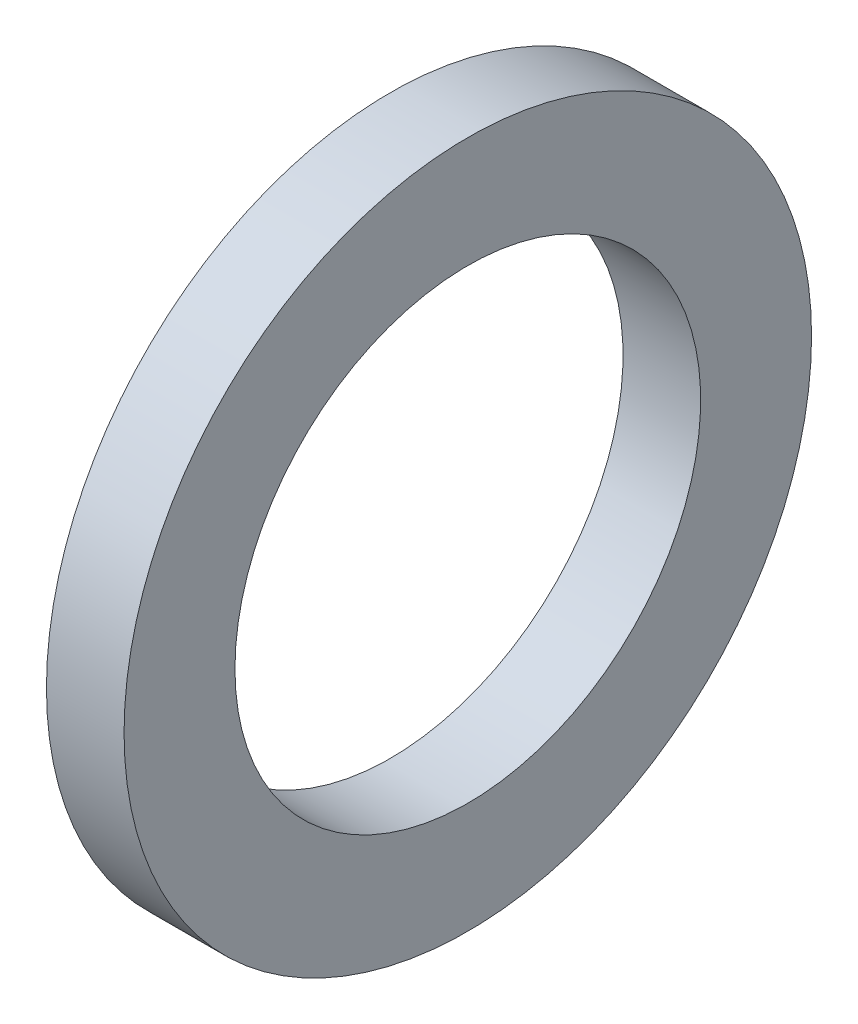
ISO-10303-21;
HEADER;
FILE_DESCRIPTION(('STEP AP214'),'2;1');
FILE_NAME('part.step','',(''),(''),'','','');
FILE_SCHEMA(('AUTOMOTIVE_DESIGN { 1 0 10303 214 1 1 1 1 }'));
ENDSEC;
DATA;
#1=APPLICATION_CONTEXT('core data for automotive mechanical design processes');
#2=APPLICATION_PROTOCOL_DEFINITION('international standard','automotive_design',2000,#1);
#3=PRODUCT_CONTEXT('',#1,'mechanical');
#4=PRODUCT('Part','Part','',(#3));
#5=PRODUCT_RELATED_PRODUCT_CATEGORY('part','',(#4));
#6=PRODUCT_DEFINITION_FORMATION('','',#4);
#7=PRODUCT_DEFINITION_CONTEXT('part definition',#1,'design');
#8=PRODUCT_DEFINITION('design','',#6,#7);
#9=PRODUCT_DEFINITION_SHAPE('','',#8);
#10=(LENGTH_UNIT() NAMED_UNIT(*) SI_UNIT(.MILLI.,.METRE.));
#11=(NAMED_UNIT(*) PLANE_ANGLE_UNIT() SI_UNIT($,.RADIAN.));
#12=(NAMED_UNIT(*) SI_UNIT($,.STERADIAN.) SOLID_ANGLE_UNIT());
#13=UNCERTAINTY_MEASURE_WITH_UNIT(LENGTH_MEASURE(1.E-05),#10,'distance_accuracy_value','');
#14=(GEOMETRIC_REPRESENTATION_CONTEXT(3) GLOBAL_UNCERTAINTY_ASSIGNED_CONTEXT((#13)) GLOBAL_UNIT_ASSIGNED_CONTEXT((#10,
#11,#12)) REPRESENTATION_CONTEXT('',''));
#15=CARTESIAN_POINT('',(0.,0.,0.));
#16=DIRECTION('',(0.,0.,1.));
#17=DIRECTION('',(1.,0.,0.));
#18=AXIS2_PLACEMENT_3D('',#15,#16,#17);
#19=CARTESIAN_POINT('',(-34.9249999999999,0.,0.));
#20=DIRECTION('',(-1.,0.,0.));
#21=DIRECTION('',(0.,0.,1.));
#22=AXIS2_PLACEMENT_3D('',#19,#20,#21);
#23=CYLINDRICAL_SURFACE('',#22,10.5);
#24=CARTESIAN_POINT('',(0.,0.,0.));
#25=DIRECTION('',(-1.,0.,0.));
#26=DIRECTION('',(0.,0.,1.));
#27=AXIS2_PLACEMENT_3D('',#24,#25,#26);
#28=CIRCLE('',#27,10.5);
#29=CARTESIAN_POINT('',(0.,0.,10.5));
#30=VERTEX_POINT('',#29);
#31=EDGE_CURVE('E10',#30,#30,#28,.T.);
#32=ORIENTED_EDGE('',*,*,#31,.F.);
#33=EDGE_LOOP('',(#32));
#34=FACE_BOUND('',#33,.T.);
#35=CARTESIAN_POINT('',(-3.5,0.,0.));
#36=DIRECTION('',(-1.,0.,0.));
#37=DIRECTION('',(0.,0.,1.));
#38=AXIS2_PLACEMENT_3D('',#35,#36,#37);
#39=CIRCLE('',#38,10.5);
#40=CARTESIAN_POINT('',(-3.5,0.,10.5));
#41=VERTEX_POINT('',#40);
#42=EDGE_CURVE('E51',#41,#41,#39,.T.);
#43=ORIENTED_EDGE('',*,*,#42,.T.);
#44=EDGE_LOOP('',(#43));
#45=FACE_BOUND('',#44,.T.);
#46=ADVANCED_FACE('F40',(#34,#45),#23,.F.);
#47=CARTESIAN_POINT('',(0.,10.5,0.));
#48=DIRECTION('',(-1.,0.,0.));
#49=DIRECTION('',(0.,0.,1.));
#50=AXIS2_PLACEMENT_3D('',#47,#48,#49);
#51=PLANE('',#50);
#52=CARTESIAN_POINT('',(0.,0.,0.));
#53=DIRECTION('',(-1.,0.,0.));
#54=DIRECTION('',(0.,0.,1.));
#55=AXIS2_PLACEMENT_3D('',#52,#53,#54);
#56=CIRCLE('',#55,15.5);
#57=CARTESIAN_POINT('',(0.,0.,15.5));
#58=VERTEX_POINT('',#57);
#59=EDGE_CURVE('E43',#58,#58,#56,.T.);
#60=ORIENTED_EDGE('',*,*,#59,.F.);
#61=EDGE_LOOP('',(#60));
#62=FACE_BOUND('',#61,.T.);
#63=ORIENTED_EDGE('',*,*,#31,.T.);
#64=EDGE_LOOP('',(#63));
#65=FACE_BOUND('',#64,.T.);
#66=ADVANCED_FACE('F68',(#62,#65),#51,.F.);
#67=CARTESIAN_POINT('',(-34.9249999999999,0.,0.));
#68=DIRECTION('',(-1.,0.,0.));
#69=DIRECTION('',(0.,0.,1.));
#70=AXIS2_PLACEMENT_3D('',#67,#68,#69);
#71=CYLINDRICAL_SURFACE('',#70,15.5);
#72=CARTESIAN_POINT('',(-3.5,0.,0.));
#73=DIRECTION('',(-1.,0.,0.));
#74=DIRECTION('',(0.,0.,1.));
#75=AXIS2_PLACEMENT_3D('',#72,#73,#74);
#76=CIRCLE('',#75,15.5);
#77=CARTESIAN_POINT('',(-3.5,0.,15.5));
#78=VERTEX_POINT('',#77);
#79=EDGE_CURVE('E50',#78,#78,#76,.T.);
#80=ORIENTED_EDGE('',*,*,#79,.F.);
#81=EDGE_LOOP('',(#80));
#82=FACE_BOUND('',#81,.T.);
#83=ORIENTED_EDGE('',*,*,#59,.T.);
#84=EDGE_LOOP('',(#83));
#85=FACE_BOUND('',#84,.T.);
#86=ADVANCED_FACE('F62',(#82,#85),#71,.T.);
#87=CARTESIAN_POINT('',(-3.5,15.5,0.));
#88=DIRECTION('',(1.,0.,0.));
#89=DIRECTION('',(0.,0.,-1.));
#90=AXIS2_PLACEMENT_3D('',#87,#88,#89);
#91=PLANE('',#90);
#92=ORIENTED_EDGE('',*,*,#42,.F.);
#93=EDGE_LOOP('',(#92));
#94=FACE_BOUND('',#93,.T.);
#95=ORIENTED_EDGE('',*,*,#79,.T.);
#96=EDGE_LOOP('',(#95));
#97=FACE_BOUND('',#96,.T.);
#98=ADVANCED_FACE('F59',(#94,#97),#91,.F.);
#99=CLOSED_SHELL('',(#46,#66,#86,#98));
#100=MANIFOLD_SOLID_BREP('B2',#99);
#101=ADVANCED_BREP_SHAPE_REPRESENTATION('',(#18,#100),#14);
#102=SHAPE_DEFINITION_REPRESENTATION(#9,#101);
ENDSEC;
END-ISO-10303-21;
